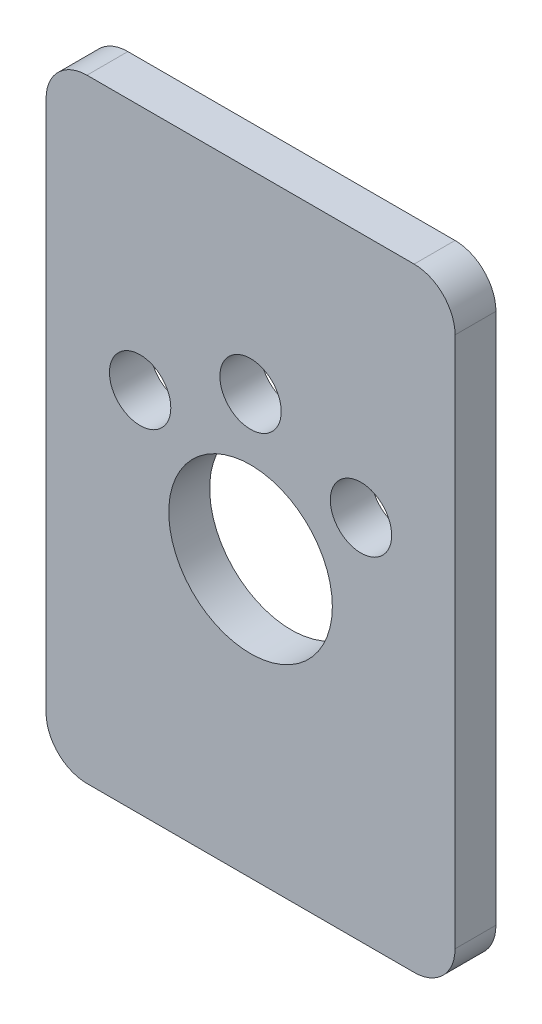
ISO-10303-21;
HEADER;
FILE_DESCRIPTION(('STEP AP214'),'2;1');
FILE_NAME('part.step','',(''),(''),'','','');
FILE_SCHEMA(('AUTOMOTIVE_DESIGN { 1 0 10303 214 1 1 1 1 }'));
ENDSEC;
DATA;
#1=APPLICATION_CONTEXT('core data for automotive mechanical design processes');
#2=APPLICATION_PROTOCOL_DEFINITION('international standard','automotive_design',2000,#1);
#3=PRODUCT_CONTEXT('',#1,'mechanical');
#4=PRODUCT('Part','Part','',(#3));
#5=PRODUCT_RELATED_PRODUCT_CATEGORY('part','',(#4));
#6=PRODUCT_DEFINITION_FORMATION('','',#4);
#7=PRODUCT_DEFINITION_CONTEXT('part definition',#1,'design');
#8=PRODUCT_DEFINITION('design','',#6,#7);
#9=PRODUCT_DEFINITION_SHAPE('','',#8);
#10=(LENGTH_UNIT() NAMED_UNIT(*) SI_UNIT(.MILLI.,.METRE.));
#11=(NAMED_UNIT(*) PLANE_ANGLE_UNIT() SI_UNIT($,.RADIAN.));
#12=(NAMED_UNIT(*) SI_UNIT($,.STERADIAN.) SOLID_ANGLE_UNIT());
#13=UNCERTAINTY_MEASURE_WITH_UNIT(LENGTH_MEASURE(1.E-05),#10,'distance_accuracy_value','');
#14=(GEOMETRIC_REPRESENTATION_CONTEXT(3) GLOBAL_UNCERTAINTY_ASSIGNED_CONTEXT((#13)) GLOBAL_UNIT_ASSIGNED_CONTEXT((#10,
#11,#12)) REPRESENTATION_CONTEXT('',''));
#15=CARTESIAN_POINT('',(0.,0.,0.));
#16=DIRECTION('',(0.,0.,1.));
#17=DIRECTION('',(1.,0.,0.));
#18=AXIS2_PLACEMENT_3D('',#15,#16,#17);
#19=CARTESIAN_POINT('',(-40.,65.,10.));
#20=DIRECTION('',(0.,0.,1.));
#21=DIRECTION('',(1.,0.,0.));
#22=AXIS2_PLACEMENT_3D('',#19,#20,#21);
#23=PLANE('',#22);
#24=CARTESIAN_POINT('',(0.,27.5,10.));
#25=DIRECTION('',(0.,0.,1.));
#26=DIRECTION('',(1.,0.,0.));
#27=AXIS2_PLACEMENT_3D('',#24,#25,#26);
#28=CIRCLE('',#27,7.5);
#29=CARTESIAN_POINT('',(7.5,27.5,10.));
#30=VERTEX_POINT('',#29);
#31=EDGE_CURVE('E232',#30,#30,#28,.T.);
#32=ORIENTED_EDGE('',*,*,#31,.F.);
#33=EDGE_LOOP('',(#32));
#34=FACE_BOUND('',#33,.T.);
#35=CARTESIAN_POINT('',(0.,-7.50000000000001,10.));
#36=DIRECTION('',(0.,0.,1.));
#37=DIRECTION('',(1.,0.,0.));
#38=AXIS2_PLACEMENT_3D('',#35,#36,#37);
#39=CIRCLE('',#38,20.);
#40=CARTESIAN_POINT('',(20.,-7.50000000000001,10.));
#41=VERTEX_POINT('',#40);
#42=EDGE_CURVE('E114',#41,#41,#39,.T.);
#43=ORIENTED_EDGE('',*,*,#42,.F.);
#44=EDGE_LOOP('',(#43));
#45=FACE_BOUND('',#44,.T.);
#46=CARTESIAN_POINT('',(-40.,65.,10.));
#47=DIRECTION('',(0.,0.,1.));
#48=DIRECTION('',(1.,0.,0.));
#49=AXIS2_PLACEMENT_3D('',#46,#47,#48);
#50=CIRCLE('',#49,10.);
#51=CARTESIAN_POINT('',(-40.,75.,10.));
#52=VERTEX_POINT('',#51);
#53=CARTESIAN_POINT('',(-50.,65.,10.));
#54=VERTEX_POINT('',#53);
#55=EDGE_CURVE('E132',#52,#54,#50,.T.);
#56=ORIENTED_EDGE('',*,*,#55,.T.);
#57=DIRECTION('',(0.,-1.,0.));
#58=VECTOR('',#57,1.);
#59=CARTESIAN_POINT('',(-50.,65.,10.));
#60=LINE('',#59,#58);
#61=CARTESIAN_POINT('',(-50.,-65.,10.));
#62=VERTEX_POINT('',#61);
#63=EDGE_CURVE('E109',#54,#62,#60,.T.);
#64=ORIENTED_EDGE('',*,*,#63,.T.);
#65=CARTESIAN_POINT('',(-40.,-65.,10.));
#66=DIRECTION('',(0.,0.,1.));
#67=DIRECTION('',(1.,0.,0.));
#68=AXIS2_PLACEMENT_3D('',#65,#66,#67);
#69=CIRCLE('',#68,10.);
#70=CARTESIAN_POINT('',(-40.,-75.,10.));
#71=VERTEX_POINT('',#70);
#72=EDGE_CURVE('E135',#62,#71,#69,.T.);
#73=ORIENTED_EDGE('',*,*,#72,.T.);
#74=DIRECTION('',(1.,0.,0.));
#75=VECTOR('',#74,1.);
#76=CARTESIAN_POINT('',(-40.,-75.,10.));
#77=LINE('',#76,#75);
#78=CARTESIAN_POINT('',(40.,-75.,10.));
#79=VERTEX_POINT('',#78);
#80=EDGE_CURVE('E137',#71,#79,#77,.T.);
#81=ORIENTED_EDGE('',*,*,#80,.T.);
#82=CARTESIAN_POINT('',(40.,-65.,10.));
#83=DIRECTION('',(0.,0.,1.));
#84=DIRECTION('',(1.,0.,0.));
#85=AXIS2_PLACEMENT_3D('',#82,#83,#84);
#86=CIRCLE('',#85,10.);
#87=CARTESIAN_POINT('',(50.,-65.,10.));
#88=VERTEX_POINT('',#87);
#89=EDGE_CURVE('E139',#79,#88,#86,.T.);
#90=ORIENTED_EDGE('',*,*,#89,.T.);
#91=DIRECTION('',(0.,1.,0.));
#92=VECTOR('',#91,1.);
#93=CARTESIAN_POINT('',(50.,-65.,10.));
#94=LINE('',#93,#92);
#95=CARTESIAN_POINT('',(50.,65.,10.));
#96=VERTEX_POINT('',#95);
#97=EDGE_CURVE('E141',#88,#96,#94,.T.);
#98=ORIENTED_EDGE('',*,*,#97,.T.);
#99=CARTESIAN_POINT('',(40.,65.,10.));
#100=DIRECTION('',(0.,0.,1.));
#101=DIRECTION('',(1.,0.,0.));
#102=AXIS2_PLACEMENT_3D('',#99,#100,#101);
#103=CIRCLE('',#102,10.);
#104=CARTESIAN_POINT('',(40.,75.,10.));
#105=VERTEX_POINT('',#104);
#106=EDGE_CURVE('E50',#96,#105,#103,.T.);
#107=ORIENTED_EDGE('',*,*,#106,.T.);
#108=DIRECTION('',(-1.,0.,0.));
#109=VECTOR('',#108,1.);
#110=CARTESIAN_POINT('',(40.,75.,10.));
#111=LINE('',#110,#109);
#112=EDGE_CURVE('E45',#105,#52,#111,.T.);
#113=ORIENTED_EDGE('',*,*,#112,.T.);
#114=EDGE_LOOP('',(#56,#64,#73,#81,#90,#98,#107,#113));
#115=FACE_BOUND('',#114,.T.);
#116=CARTESIAN_POINT('',(-27.,14.8,10.));
#117=DIRECTION('',(0.,0.,1.));
#118=DIRECTION('',(1.,0.,0.));
#119=AXIS2_PLACEMENT_3D('',#116,#117,#118);
#120=CIRCLE('',#119,7.5);
#121=CARTESIAN_POINT('',(-19.5,14.8,10.));
#122=VERTEX_POINT('',#121);
#123=EDGE_CURVE('E238',#122,#122,#120,.T.);
#124=ORIENTED_EDGE('',*,*,#123,.F.);
#125=EDGE_LOOP('',(#124));
#126=FACE_BOUND('',#125,.T.);
#127=CARTESIAN_POINT('',(27.,14.8,10.));
#128=DIRECTION('',(0.,0.,1.));
#129=DIRECTION('',(1.,0.,0.));
#130=AXIS2_PLACEMENT_3D('',#127,#128,#129);
#131=CIRCLE('',#130,7.5);
#132=CARTESIAN_POINT('',(34.5,14.8,10.));
#133=VERTEX_POINT('',#132);
#134=EDGE_CURVE('E221',#133,#133,#131,.T.);
#135=ORIENTED_EDGE('',*,*,#134,.F.);
#136=EDGE_LOOP('',(#135));
#137=FACE_BOUND('',#136,.T.);
#138=ADVANCED_FACE('F30',(#34,#45,#115,#126,#137),#23,.T.);
#139=CARTESIAN_POINT('',(-40.,65.,0.));
#140=DIRECTION('',(0.,0.,1.));
#141=DIRECTION('',(1.,0.,0.));
#142=AXIS2_PLACEMENT_3D('',#139,#140,#141);
#143=PLANE('',#142);
#144=CARTESIAN_POINT('',(0.,27.5,0.));
#145=DIRECTION('',(0.,0.,1.));
#146=DIRECTION('',(1.,0.,0.));
#147=AXIS2_PLACEMENT_3D('',#144,#145,#146);
#148=CIRCLE('',#147,7.5);
#149=CARTESIAN_POINT('',(7.5,27.5,0.));
#150=VERTEX_POINT('',#149);
#151=EDGE_CURVE('E227',#150,#150,#148,.T.);
#152=ORIENTED_EDGE('',*,*,#151,.T.);
#153=EDGE_LOOP('',(#152));
#154=FACE_BOUND('',#153,.T.);
#155=CARTESIAN_POINT('',(0.,-7.50000000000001,0.));
#156=DIRECTION('',(0.,0.,1.));
#157=DIRECTION('',(1.,0.,0.));
#158=AXIS2_PLACEMENT_3D('',#155,#156,#157);
#159=CIRCLE('',#158,20.);
#160=CARTESIAN_POINT('',(20.,-7.50000000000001,0.));
#161=VERTEX_POINT('',#160);
#162=EDGE_CURVE('E117',#161,#161,#159,.T.);
#163=ORIENTED_EDGE('',*,*,#162,.T.);
#164=EDGE_LOOP('',(#163));
#165=FACE_BOUND('',#164,.T.);
#166=CARTESIAN_POINT('',(-40.,65.,0.));
#167=DIRECTION('',(0.,0.,1.));
#168=DIRECTION('',(1.,0.,0.));
#169=AXIS2_PLACEMENT_3D('',#166,#167,#168);
#170=CIRCLE('',#169,10.);
#171=CARTESIAN_POINT('',(-40.,75.,0.));
#172=VERTEX_POINT('',#171);
#173=CARTESIAN_POINT('',(-50.,65.,0.));
#174=VERTEX_POINT('',#173);
#175=EDGE_CURVE('E100',#172,#174,#170,.T.);
#176=ORIENTED_EDGE('',*,*,#175,.F.);
#177=DIRECTION('',(-1.,0.,0.));
#178=VECTOR('',#177,1.);
#179=CARTESIAN_POINT('',(40.,75.,0.));
#180=LINE('',#179,#178);
#181=CARTESIAN_POINT('',(40.,75.,0.));
#182=VERTEX_POINT('',#181);
#183=EDGE_CURVE('E130',#182,#172,#180,.T.);
#184=ORIENTED_EDGE('',*,*,#183,.F.);
#185=CARTESIAN_POINT('',(40.,65.,0.));
#186=DIRECTION('',(0.,0.,1.));
#187=DIRECTION('',(1.,0.,0.));
#188=AXIS2_PLACEMENT_3D('',#185,#186,#187);
#189=CIRCLE('',#188,10.);
#190=CARTESIAN_POINT('',(50.,65.,0.));
#191=VERTEX_POINT('',#190);
#192=EDGE_CURVE('E128',#191,#182,#189,.T.);
#193=ORIENTED_EDGE('',*,*,#192,.F.);
#194=DIRECTION('',(0.,1.,0.));
#195=VECTOR('',#194,1.);
#196=CARTESIAN_POINT('',(50.,-65.,0.));
#197=LINE('',#196,#195);
#198=CARTESIAN_POINT('',(50.,-65.,0.));
#199=VERTEX_POINT('',#198);
#200=EDGE_CURVE('E126',#199,#191,#197,.T.);
#201=ORIENTED_EDGE('',*,*,#200,.F.);
#202=CARTESIAN_POINT('',(40.,-65.,0.));
#203=DIRECTION('',(0.,0.,1.));
#204=DIRECTION('',(1.,0.,0.));
#205=AXIS2_PLACEMENT_3D('',#202,#203,#204);
#206=CIRCLE('',#205,10.);
#207=CARTESIAN_POINT('',(40.,-75.,0.));
#208=VERTEX_POINT('',#207);
#209=EDGE_CURVE('E124',#208,#199,#206,.T.);
#210=ORIENTED_EDGE('',*,*,#209,.F.);
#211=DIRECTION('',(1.,0.,0.));
#212=VECTOR('',#211,1.);
#213=CARTESIAN_POINT('',(-40.,-75.,0.));
#214=LINE('',#213,#212);
#215=CARTESIAN_POINT('',(-40.,-75.,0.));
#216=VERTEX_POINT('',#215);
#217=EDGE_CURVE('E122',#216,#208,#214,.T.);
#218=ORIENTED_EDGE('',*,*,#217,.F.);
#219=CARTESIAN_POINT('',(-40.,-65.,0.));
#220=DIRECTION('',(0.,0.,1.));
#221=DIRECTION('',(1.,0.,0.));
#222=AXIS2_PLACEMENT_3D('',#219,#220,#221);
#223=CIRCLE('',#222,10.);
#224=CARTESIAN_POINT('',(-50.,-65.,0.));
#225=VERTEX_POINT('',#224);
#226=EDGE_CURVE('E102',#225,#216,#223,.T.);
#227=ORIENTED_EDGE('',*,*,#226,.F.);
#228=DIRECTION('',(0.,-1.,0.));
#229=VECTOR('',#228,1.);
#230=CARTESIAN_POINT('',(-50.,65.,0.));
#231=LINE('',#230,#229);
#232=EDGE_CURVE('E95',#174,#225,#231,.T.);
#233=ORIENTED_EDGE('',*,*,#232,.F.);
#234=EDGE_LOOP('',(#176,#184,#193,#201,#210,#218,#227,#233));
#235=FACE_BOUND('',#234,.T.);
#236=CARTESIAN_POINT('',(-27.,14.8,0.));
#237=DIRECTION('',(0.,0.,1.));
#238=DIRECTION('',(1.,0.,0.));
#239=AXIS2_PLACEMENT_3D('',#236,#237,#238);
#240=CIRCLE('',#239,7.5);
#241=CARTESIAN_POINT('',(-19.5,14.8,0.));
#242=VERTEX_POINT('',#241);
#243=EDGE_CURVE('E235',#242,#242,#240,.T.);
#244=ORIENTED_EDGE('',*,*,#243,.T.);
#245=EDGE_LOOP('',(#244));
#246=FACE_BOUND('',#245,.T.);
#247=CARTESIAN_POINT('',(27.,14.8,0.));
#248=DIRECTION('',(0.,0.,1.));
#249=DIRECTION('',(1.,0.,0.));
#250=AXIS2_PLACEMENT_3D('',#247,#248,#249);
#251=CIRCLE('',#250,7.5);
#252=CARTESIAN_POINT('',(34.5,14.8,0.));
#253=VERTEX_POINT('',#252);
#254=EDGE_CURVE('E224',#253,#253,#251,.T.);
#255=ORIENTED_EDGE('',*,*,#254,.T.);
#256=EDGE_LOOP('',(#255));
#257=FACE_BOUND('',#256,.T.);
#258=ADVANCED_FACE('F96',(#154,#165,#235,#246,#257),#143,.F.);
#259=CARTESIAN_POINT('',(-40.,65.,10.));
#260=DIRECTION('',(0.,0.,-1.));
#261=DIRECTION('',(-1.,0.,0.));
#262=AXIS2_PLACEMENT_3D('',#259,#260,#261);
#263=CYLINDRICAL_SURFACE('',#262,10.);
#264=ORIENTED_EDGE('',*,*,#175,.T.);
#265=DIRECTION('',(0.,0.,-1.));
#266=VECTOR('',#265,1.);
#267=CARTESIAN_POINT('',(-50.,65.,10.));
#268=LINE('',#267,#266);
#269=EDGE_CURVE('E11',#54,#174,#268,.T.);
#270=ORIENTED_EDGE('',*,*,#269,.F.);
#271=ORIENTED_EDGE('',*,*,#55,.F.);
#272=DIRECTION('',(0.,0.,-1.));
#273=VECTOR('',#272,1.);
#274=CARTESIAN_POINT('',(-40.,75.,10.));
#275=LINE('',#274,#273);
#276=EDGE_CURVE('E113',#52,#172,#275,.T.);
#277=ORIENTED_EDGE('',*,*,#276,.T.);
#278=EDGE_LOOP('',(#264,#270,#271,#277));
#279=FACE_BOUND('',#278,.T.);
#280=ADVANCED_FACE('F32',(#279),#263,.T.);
#281=CARTESIAN_POINT('',(-50.,65.,10.));
#282=DIRECTION('',(1.,0.,0.));
#283=DIRECTION('',(0.,1.,0.));
#284=AXIS2_PLACEMENT_3D('',#281,#282,#283);
#285=PLANE('',#284);
#286=ORIENTED_EDGE('',*,*,#232,.T.);
#287=DIRECTION('',(0.,0.,-1.));
#288=VECTOR('',#287,1.);
#289=CARTESIAN_POINT('',(-50.,-65.,10.));
#290=LINE('',#289,#288);
#291=EDGE_CURVE('E38',#62,#225,#290,.T.);
#292=ORIENTED_EDGE('',*,*,#291,.F.);
#293=ORIENTED_EDGE('',*,*,#63,.F.);
#294=ORIENTED_EDGE('',*,*,#269,.T.);
#295=EDGE_LOOP('',(#286,#292,#293,#294));
#296=FACE_BOUND('',#295,.T.);
#297=ADVANCED_FACE('F108',(#296),#285,.F.);
#298=CARTESIAN_POINT('',(-40.,-65.,10.));
#299=DIRECTION('',(0.,0.,-1.));
#300=DIRECTION('',(-1.,0.,0.));
#301=AXIS2_PLACEMENT_3D('',#298,#299,#300);
#302=CYLINDRICAL_SURFACE('',#301,10.);
#303=ORIENTED_EDGE('',*,*,#226,.T.);
#304=DIRECTION('',(0.,0.,-1.));
#305=VECTOR('',#304,1.);
#306=CARTESIAN_POINT('',(-40.,-75.,10.));
#307=LINE('',#306,#305);
#308=EDGE_CURVE('E158',#71,#216,#307,.T.);
#309=ORIENTED_EDGE('',*,*,#308,.F.);
#310=ORIENTED_EDGE('',*,*,#72,.F.);
#311=ORIENTED_EDGE('',*,*,#291,.T.);
#312=EDGE_LOOP('',(#303,#309,#310,#311));
#313=FACE_BOUND('',#312,.T.);
#314=ADVANCED_FACE('F162',(#313),#302,.T.);
#315=CARTESIAN_POINT('',(-40.,-75.,10.));
#316=DIRECTION('',(0.,1.,0.));
#317=DIRECTION('',(0.,0.,1.));
#318=AXIS2_PLACEMENT_3D('',#315,#316,#317);
#319=PLANE('',#318);
#320=ORIENTED_EDGE('',*,*,#217,.T.);
#321=DIRECTION('',(0.,0.,-1.));
#322=VECTOR('',#321,1.);
#323=CARTESIAN_POINT('',(40.,-75.,10.));
#324=LINE('',#323,#322);
#325=EDGE_CURVE('E155',#79,#208,#324,.T.);
#326=ORIENTED_EDGE('',*,*,#325,.F.);
#327=ORIENTED_EDGE('',*,*,#80,.F.);
#328=ORIENTED_EDGE('',*,*,#308,.T.);
#329=EDGE_LOOP('',(#320,#326,#327,#328));
#330=FACE_BOUND('',#329,.T.);
#331=ADVANCED_FACE('F170',(#330),#319,.F.);
#332=CARTESIAN_POINT('',(40.,-65.,10.));
#333=DIRECTION('',(0.,0.,-1.));
#334=DIRECTION('',(-1.,0.,0.));
#335=AXIS2_PLACEMENT_3D('',#332,#333,#334);
#336=CYLINDRICAL_SURFACE('',#335,10.);
#337=ORIENTED_EDGE('',*,*,#209,.T.);
#338=DIRECTION('',(0.,0.,-1.));
#339=VECTOR('',#338,1.);
#340=CARTESIAN_POINT('',(50.,-65.,10.));
#341=LINE('',#340,#339);
#342=EDGE_CURVE('E152',#88,#199,#341,.T.);
#343=ORIENTED_EDGE('',*,*,#342,.F.);
#344=ORIENTED_EDGE('',*,*,#89,.F.);
#345=ORIENTED_EDGE('',*,*,#325,.T.);
#346=EDGE_LOOP('',(#337,#343,#344,#345));
#347=FACE_BOUND('',#346,.T.);
#348=ADVANCED_FACE('F173',(#347),#336,.T.);
#349=CARTESIAN_POINT('',(50.,-65.,10.));
#350=DIRECTION('',(-1.,0.,0.));
#351=DIRECTION('',(0.,0.,1.));
#352=AXIS2_PLACEMENT_3D('',#349,#350,#351);
#353=PLANE('',#352);
#354=ORIENTED_EDGE('',*,*,#200,.T.);
#355=DIRECTION('',(0.,0.,-1.));
#356=VECTOR('',#355,1.);
#357=CARTESIAN_POINT('',(50.,65.,10.));
#358=LINE('',#357,#356);
#359=EDGE_CURVE('E149',#96,#191,#358,.T.);
#360=ORIENTED_EDGE('',*,*,#359,.F.);
#361=ORIENTED_EDGE('',*,*,#97,.F.);
#362=ORIENTED_EDGE('',*,*,#342,.T.);
#363=EDGE_LOOP('',(#354,#360,#361,#362));
#364=FACE_BOUND('',#363,.T.);
#365=ADVANCED_FACE('F178',(#364),#353,.F.);
#366=CARTESIAN_POINT('',(40.,65.,10.));
#367=DIRECTION('',(0.,0.,-1.));
#368=DIRECTION('',(-1.,0.,0.));
#369=AXIS2_PLACEMENT_3D('',#366,#367,#368);
#370=CYLINDRICAL_SURFACE('',#369,10.);
#371=ORIENTED_EDGE('',*,*,#192,.T.);
#372=DIRECTION('',(0.,0.,-1.));
#373=VECTOR('',#372,1.);
#374=CARTESIAN_POINT('',(40.,75.,10.));
#375=LINE('',#374,#373);
#376=EDGE_CURVE('E146',#105,#182,#375,.T.);
#377=ORIENTED_EDGE('',*,*,#376,.F.);
#378=ORIENTED_EDGE('',*,*,#106,.F.);
#379=ORIENTED_EDGE('',*,*,#359,.T.);
#380=EDGE_LOOP('',(#371,#377,#378,#379));
#381=FACE_BOUND('',#380,.T.);
#382=ADVANCED_FACE('F181',(#381),#370,.T.);
#383=CARTESIAN_POINT('',(40.,75.,10.));
#384=DIRECTION('',(0.,-1.,0.));
#385=DIRECTION('',(1.,0.,0.));
#386=AXIS2_PLACEMENT_3D('',#383,#384,#385);
#387=PLANE('',#386);
#388=ORIENTED_EDGE('',*,*,#183,.T.);
#389=ORIENTED_EDGE('',*,*,#276,.F.);
#390=ORIENTED_EDGE('',*,*,#112,.F.);
#391=ORIENTED_EDGE('',*,*,#376,.T.);
#392=EDGE_LOOP('',(#388,#389,#390,#391));
#393=FACE_BOUND('',#392,.T.);
#394=ADVANCED_FACE('F183',(#393),#387,.F.);
#395=CARTESIAN_POINT('',(0.,-7.50000000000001,10.));
#396=DIRECTION('',(0.,0.,-1.));
#397=DIRECTION('',(-1.,0.,0.));
#398=AXIS2_PLACEMENT_3D('',#395,#396,#397);
#399=CYLINDRICAL_SURFACE('',#398,20.);
#400=ORIENTED_EDGE('',*,*,#42,.T.);
#401=EDGE_LOOP('',(#400));
#402=FACE_BOUND('',#401,.T.);
#403=ORIENTED_EDGE('',*,*,#162,.F.);
#404=EDGE_LOOP('',(#403));
#405=FACE_BOUND('',#404,.T.);
#406=ADVANCED_FACE('F185',(#402,#405),#399,.F.);
#407=CARTESIAN_POINT('',(-27.,14.8,10.));
#408=DIRECTION('',(0.,0.,-1.));
#409=DIRECTION('',(-1.,0.,0.));
#410=AXIS2_PLACEMENT_3D('',#407,#408,#409);
#411=CYLINDRICAL_SURFACE('',#410,7.5);
#412=ORIENTED_EDGE('',*,*,#123,.T.);
#413=EDGE_LOOP('',(#412));
#414=FACE_BOUND('',#413,.T.);
#415=ORIENTED_EDGE('',*,*,#243,.F.);
#416=EDGE_LOOP('',(#415));
#417=FACE_BOUND('',#416,.T.);
#418=ADVANCED_FACE('F191',(#414,#417),#411,.F.);
#419=CARTESIAN_POINT('',(0.,27.5,10.));
#420=DIRECTION('',(0.,0.,-1.));
#421=DIRECTION('',(-1.,0.,0.));
#422=AXIS2_PLACEMENT_3D('',#419,#420,#421);
#423=CYLINDRICAL_SURFACE('',#422,7.5);
#424=ORIENTED_EDGE('',*,*,#31,.T.);
#425=EDGE_LOOP('',(#424));
#426=FACE_BOUND('',#425,.T.);
#427=ORIENTED_EDGE('',*,*,#151,.F.);
#428=EDGE_LOOP('',(#427));
#429=FACE_BOUND('',#428,.T.);
#430=ADVANCED_FACE('F208',(#426,#429),#423,.F.);
#431=CARTESIAN_POINT('',(27.,14.8,10.));
#432=DIRECTION('',(0.,0.,-1.));
#433=DIRECTION('',(-1.,0.,0.));
#434=AXIS2_PLACEMENT_3D('',#431,#432,#433);
#435=CYLINDRICAL_SURFACE('',#434,7.5);
#436=ORIENTED_EDGE('',*,*,#134,.T.);
#437=EDGE_LOOP('',(#436));
#438=FACE_BOUND('',#437,.T.);
#439=ORIENTED_EDGE('',*,*,#254,.F.);
#440=EDGE_LOOP('',(#439));
#441=FACE_BOUND('',#440,.T.);
#442=ADVANCED_FACE('F212',(#438,#441),#435,.F.);
#443=CLOSED_SHELL('',(#138,#258,#280,#297,#314,#331,#348,#365,#382,#394,#406,#418,#430,#442));
#444=MANIFOLD_SOLID_BREP('B2',#443);
#445=ADVANCED_BREP_SHAPE_REPRESENTATION('',(#18,#444),#14);
#446=SHAPE_DEFINITION_REPRESENTATION(#9,#445);
ENDSEC;
END-ISO-10303-21;
